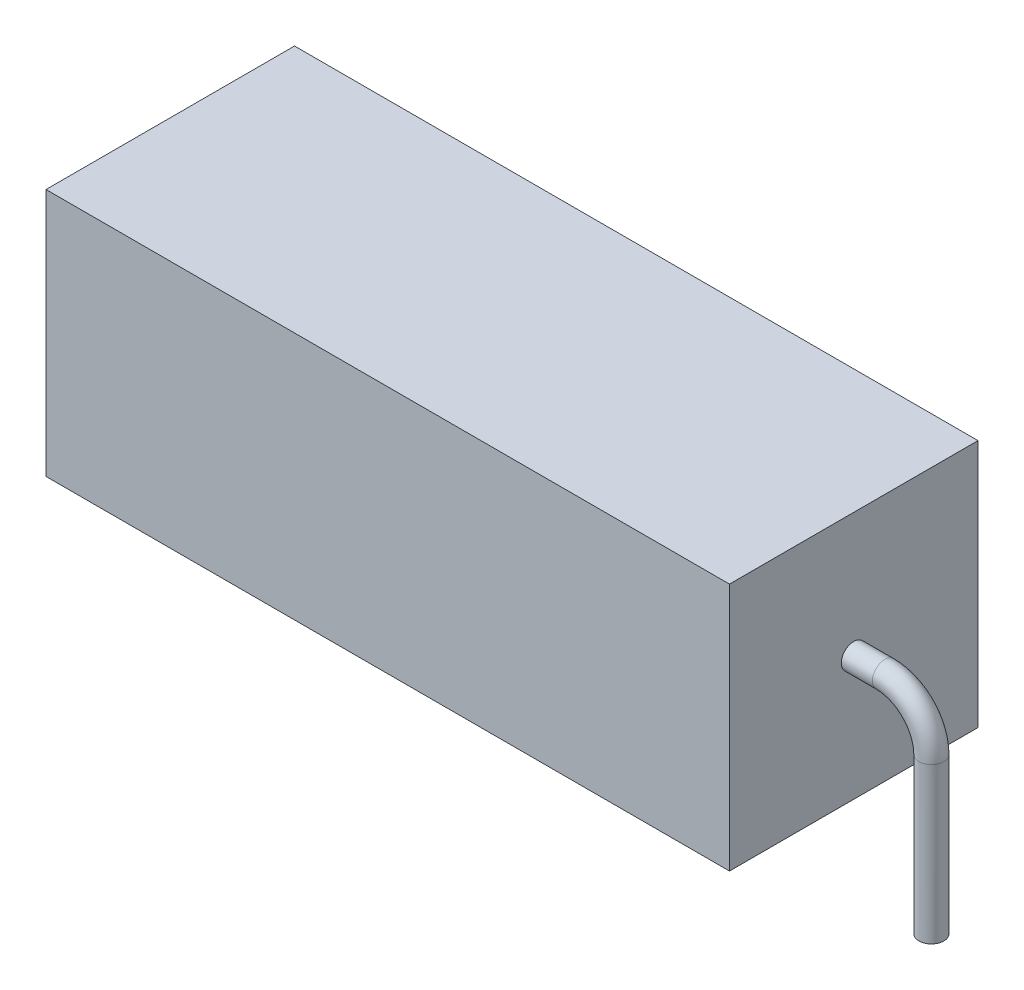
from build123d import *

# Parameters (mm, degrees)
SKETCH_2_W      = 8
SKETCH_2_H      = 8
EXTRUDE_1_DEPTH = 22
SKETCH_4_R      = 0.4


with BuildPart() as part:
    # Sketch 2 → Extrude 1 (new body)
    with BuildSketch(Plane(origin=(0, 0, 0), x_dir=(0, 0, -1), z_dir=(1, 0, 0))):
        with Locations((4, 4)):
            Rectangle(SKETCH_2_W, SKETCH_2_H)
    extrude(amount=EXTRUDE_1_DEPTH)

    # Sweep 1: sweep along a path in Sketch 3
    with BuildLine(Plane.XY.offset(-4)) as sweep_1_path:
        Line((22, 4), (23, 4))
        ThreePointArc((23, 4), (24.060660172, 3.560660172), (24.5, 2.5))
        Line((24.5, 2.5), (24.5, -2.5))
    # Sketch 4 → Sweep 1 (sweep)
    with BuildSketch(Plane(origin=(22, 0, 0), x_dir=(0, 0, -1), z_dir=(1, 0, 0))):
        with Locations((4, 4)):
            Circle(SKETCH_4_R)
    sweep_1 = sweep(path=sweep_1_path.line)

    # Mirror 1: Sweep 1 across plane
    add(sweep_1.mirror(Plane(origin=(11, 0, 0), x_dir=(0, 0, 1), z_dir=(1, 0, 0))))


solid = part.part
